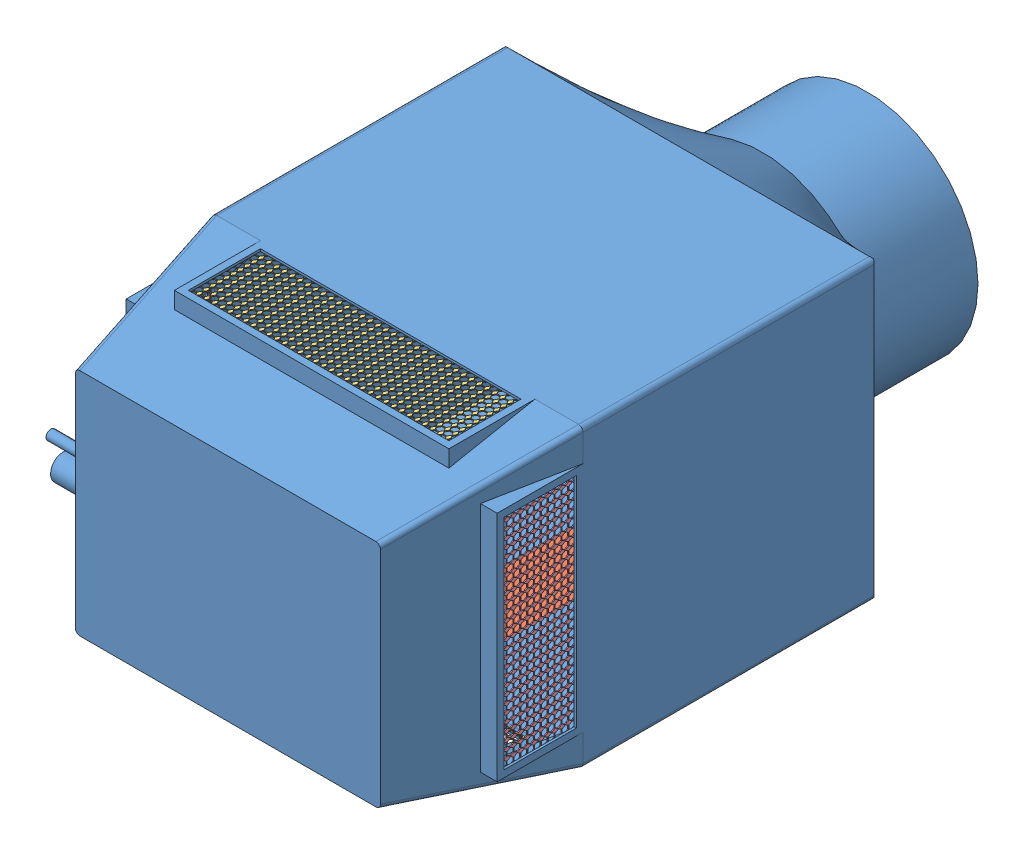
SolidWorks assembly EMSAMBLE TORRE.SLDASM, configuration Predeterminado (file format 4400). Lengths in mm.
Overall size (1605.01 1297.01 2747).
6 component instances, 4 part files, 15 mates.
Components (placement in the parent):
- torre de enfriamiento-1: torre de enfriamiento.SLDPRT [Predeterminado] at (-327.9657 -650.1814 -606.5) size (1605.01 1297.01 2747)
- VIDRIO TORRE-1: VIDRIO TORRE.SLDPRT [Predeterminado] at (319.5343 -650.1814 -556.5) x (1 0 0) z (0 -1 0) size (340 1175 4)
- PANEL LADO VIDRIO-1: PANEL LADO VIDRIO.SLDPRT [Predeterminado] at (-100.4657 -640.1814 993.5) x (1 0 0) z (0 1 0) size (1140 330 4)
- PANEL LADO VIDRIO-2: PANEL LADO VIDRIO.SLDPRT [Predeterminado] at (-100.4657 611.8186 663.4999) x (1 0 0) z (0 -1 0) size (1140 330 4)
- PANEL LADO TUBERIA-1: PANEL LADO TUBERIA.SLDPRT [Predeterminado] at (1257.0343 465.8186 663.4999) x (0 -1 0) z (-1 0 0) size (960 330 4)
- PANEL LADO TUBERIA-2: PANEL LADO TUBERIA.SLDPRT [Predeterminado] at (-317.9657 -494.1814 663.4999) x (0 1 0) z (1 0 0) size (960 330 4)
Mates (geometry in assembly coordinates):
- Coincidente3: coincident anti-aligned: plane of torre de enfriamiento-1 through (-327.9657 -650.1814 643.5) normal (0 -1 0); plane of VIDRIO TORRE-1 through (319.5343 -650.1814 618.5) normal (0 1 0)
- Distancia1: distance = 20 mm anti-aligned: plane of VIDRIO TORRE-1 through (319.5343 -654.1814 618.5) normal (0 0 1); plane of torre de enfriamiento-1 through (349.5343 621.8293 598.5) normal (0 0 -1)
- Coincidente5: coincident: plane of torre de enfriamiento-1 through (319.5343 -675.1814 -546.5) normal (1 0 0); line of VIDRIO TORRE-1 through (319.5343 -650.1814 618.5) axis (0 0 -1)
- Coincidente7: coincident anti-aligned: plane of torre de enfriamiento-1 through (-100.4657 -640.1814 993.5) normal (0 1 0); plane of PANEL LADO VIDRIO-1 through (-100.4657 -640.1814 663.4999) normal (0 -1 0)
- Coincidente8: coincident anti-aligned: plane of torre de enfriamiento-1 through (-100.4657 499349.8186 993.5) normal (0 0 -1); plane of PANEL LADO VIDRIO-1 through (-100.4657 -636.1814 993.5) normal (0 0 1)
- Coincidente9: coincident anti-aligned: plane of torre de enfriamiento-1 through (1039.5343 499349.8186 663.4999) normal (-1 0 0); plane of PANEL LADO VIDRIO-1 through (1039.5343 -636.1814 993.5) normal (1 0 0)
- Coincidente10: coincident anti-aligned: plane of torre de enfriamiento-1 through (-100.4657 611.8186 663.4999) normal (0 -1 0); plane of PANEL LADO VIDRIO-2 through (-100.4657 611.8186 993.5) normal (0 1 0)
- Coincidente11: coincident anti-aligned: plane of torre de enfriamiento-1 through (-100.4657 -500650.1814 993.5) normal (0 0 -1); plane of PANEL LADO VIDRIO-2 through (-100.4657 607.8186 993.5) normal (0 0 1)
- Coincidente12: coincident anti-aligned: plane of torre de enfriamiento-1 through (1039.5343 -500650.1814 663.4999) normal (-1 0 0); plane of PANEL LADO VIDRIO-2 through (1039.5343 607.8186 663.4999) normal (1 0 0)
- Coincidente13: coincident anti-aligned: plane of torre de enfriamiento-1 through (1257.0343 465.8186 993.5) normal (-1 0 0); plane of PANEL LADO TUBERIA-1 through (1257.0343 465.8186 993.5) normal (1 0 0)
- Coincidente14: coincident anti-aligned: plane of torre de enfriamiento-1 through (-500327.9657 -494.1814 993.5) normal (0 0 -1); plane of PANEL LADO TUBERIA-1 through (1253.0343 465.8186 993.5) normal (0 0 1)
- Coincidente15: coincident anti-aligned: plane of torre de enfriamiento-1 through (-500327.9657 -494.1814 663.4999) normal (0 1 0); plane of PANEL LADO TUBERIA-1 through (1253.0343 -494.1814 663.4999) normal (0 -1 0)
- Coincidente16: coincident anti-aligned: plane of torre de enfriamiento-1 through (-317.9657 465.8186 663.4999) normal (1 0 0); plane of PANEL LADO TUBERIA-2 through (-317.9657 -494.1814 993.5) normal (-1 0 0)
- Coincidente17: coincident anti-aligned: plane of torre de enfriamiento-1 through (499672.0343 -494.1814 993.5) normal (0 0 -1); plane of PANEL LADO TUBERIA-2 through (-313.9657 -494.1814 993.5) normal (0 0 1)
- Coincidente18: coincident anti-aligned: plane of torre de enfriamiento-1 through (499672.0343 465.8186 663.4999) normal (0 -1 0); plane of PANEL LADO TUBERIA-2 through (-313.9657 465.8186 663.4999) normal (0 1 0)
